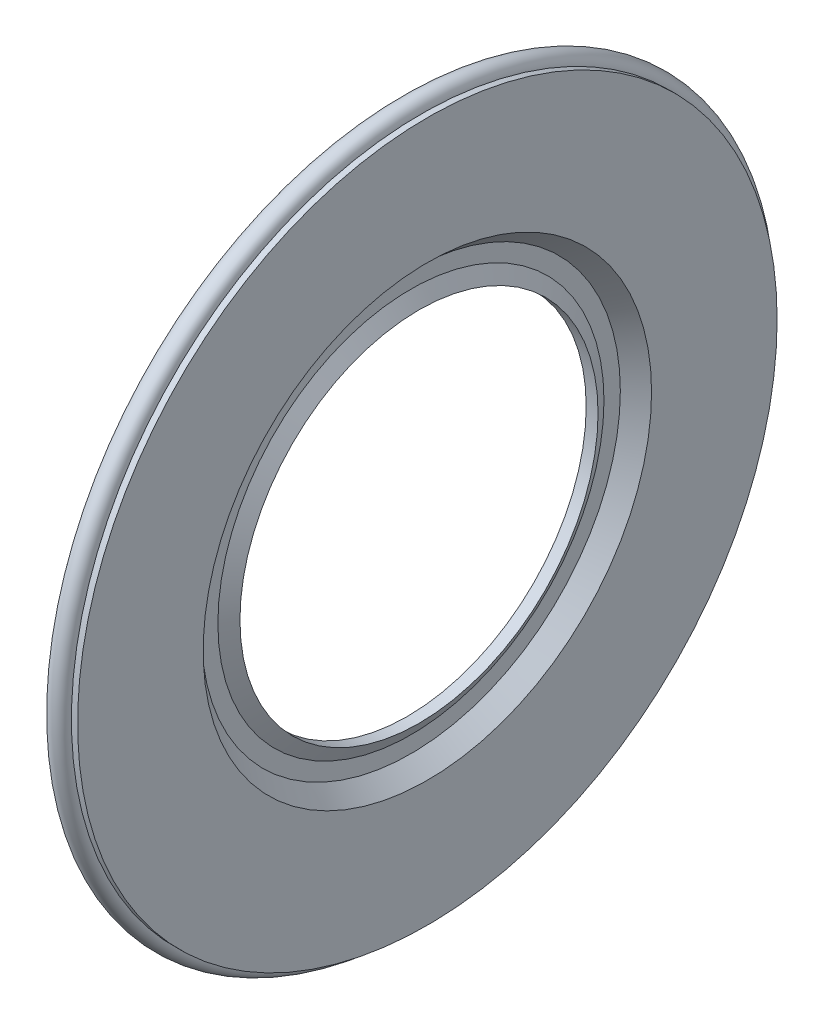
ISO-10303-21;
HEADER;
FILE_DESCRIPTION(('STEP AP214'),'2;1');
FILE_NAME('part.step','',(''),(''),'','','');
FILE_SCHEMA(('AUTOMOTIVE_DESIGN { 1 0 10303 214 1 1 1 1 }'));
ENDSEC;
DATA;
#1=APPLICATION_CONTEXT('core data for automotive mechanical design processes');
#2=APPLICATION_PROTOCOL_DEFINITION('international standard','automotive_design',2000,#1);
#3=PRODUCT_CONTEXT('',#1,'mechanical');
#4=PRODUCT('Part','Part','',(#3));
#5=PRODUCT_RELATED_PRODUCT_CATEGORY('part','',(#4));
#6=PRODUCT_DEFINITION_FORMATION('','',#4);
#7=PRODUCT_DEFINITION_CONTEXT('part definition',#1,'design');
#8=PRODUCT_DEFINITION('design','',#6,#7);
#9=PRODUCT_DEFINITION_SHAPE('','',#8);
#10=(LENGTH_UNIT() NAMED_UNIT(*) SI_UNIT(.MILLI.,.METRE.));
#11=(NAMED_UNIT(*) PLANE_ANGLE_UNIT() SI_UNIT($,.RADIAN.));
#12=(NAMED_UNIT(*) SI_UNIT($,.STERADIAN.) SOLID_ANGLE_UNIT());
#13=UNCERTAINTY_MEASURE_WITH_UNIT(LENGTH_MEASURE(1.E-05),#10,'distance_accuracy_value','');
#14=(GEOMETRIC_REPRESENTATION_CONTEXT(3) GLOBAL_UNCERTAINTY_ASSIGNED_CONTEXT((#13)) GLOBAL_UNIT_ASSIGNED_CONTEXT((#10,
#11,#12)) REPRESENTATION_CONTEXT('',''));
#15=CARTESIAN_POINT('',(0.,0.,0.));
#16=DIRECTION('',(0.,0.,1.));
#17=DIRECTION('',(1.,0.,0.));
#18=AXIS2_PLACEMENT_3D('',#15,#16,#17);
#19=CARTESIAN_POINT('',(4.58333333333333,0.,0.));
#20=DIRECTION('',(-1.,0.,0.));
#21=DIRECTION('',(0.,0.,1.));
#22=AXIS2_PLACEMENT_3D('',#19,#20,#21);
#23=CONICAL_SURFACE('',#22,3.08867513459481,1.0471975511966);
#24=CARTESIAN_POINT('',(4.68869975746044,0.,0.));
#25=DIRECTION('',(1.,0.,0.));
#26=DIRECTION('',(0.,0.,-1.));
#27=AXIS2_PLACEMENT_3D('',#24,#25,#26);
#28=CIRCLE('',#27,2.90617513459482);
#29=CARTESIAN_POINT('',(4.68869975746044,0.,-2.90617513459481));
#30=VERTEX_POINT('',#29);
#31=EDGE_CURVE('E76',#30,#30,#28,.T.);
#32=ORIENTED_EDGE('',*,*,#31,.T.);
#33=EDGE_LOOP('',(#32));
#34=FACE_BOUND('',#33,.T.);
#35=CARTESIAN_POINT('',(4.58333333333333,0.,0.));
#36=DIRECTION('',(1.,0.,0.));
#37=DIRECTION('',(0.,0.,-1.));
#38=AXIS2_PLACEMENT_3D('',#35,#36,#37);
#39=CIRCLE('',#38,3.08867513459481);
#40=CARTESIAN_POINT('',(4.58333333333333,0.,-3.08867513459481));
#41=VERTEX_POINT('',#40);
#42=EDGE_CURVE('E10',#41,#41,#39,.T.);
#43=ORIENTED_EDGE('',*,*,#42,.F.);
#44=EDGE_LOOP('',(#43));
#45=FACE_BOUND('',#44,.T.);
#46=ADVANCED_FACE('F15',(#34,#45),#23,.F.);
#47=CARTESIAN_POINT('',(4.58333333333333,3.62,0.));
#48=DIRECTION('',(-1.,0.,0.));
#49=DIRECTION('',(0.,0.,1.));
#50=AXIS2_PLACEMENT_3D('',#47,#48,#49);
#51=PLANE('',#50);
#52=ORIENTED_EDGE('',*,*,#42,.T.);
#53=EDGE_LOOP('',(#52));
#54=FACE_BOUND('',#53,.T.);
#55=CARTESIAN_POINT('',(4.58333333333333,0.,0.));
#56=DIRECTION('',(1.,0.,0.));
#57=DIRECTION('',(0.,0.,-1.));
#58=AXIS2_PLACEMENT_3D('',#55,#56,#57);
#59=CIRCLE('',#58,3.62);
#60=CARTESIAN_POINT('',(4.58333333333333,0.,-3.62));
#61=VERTEX_POINT('',#60);
#62=EDGE_CURVE('E22',#61,#61,#59,.T.);
#63=ORIENTED_EDGE('',*,*,#62,.F.);
#64=EDGE_LOOP('',(#63));
#65=FACE_BOUND('',#64,.T.);
#66=ADVANCED_FACE('F97',(#54,#65),#51,.T.);
#67=CARTESIAN_POINT('',(4.58333333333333,0.,0.));
#68=DIRECTION('',(1.,0.,0.));
#69=DIRECTION('',(0.,0.,-1.));
#70=AXIS2_PLACEMENT_3D('',#67,#68,#69);
#71=CONICAL_SURFACE('',#70,3.62,0.732815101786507);
#72=CARTESIAN_POINT('',(4.68333333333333,0.,0.));
#73=DIRECTION('',(1.,0.,0.));
#74=DIRECTION('',(0.,0.,-1.));
#75=AXIS2_PLACEMENT_3D('',#72,#73,#74);
#76=CIRCLE('',#75,3.71);
#77=CARTESIAN_POINT('',(4.68333333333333,0.,-3.71));
#78=VERTEX_POINT('',#77);
#79=EDGE_CURVE('E31',#78,#78,#76,.T.);
#80=ORIENTED_EDGE('',*,*,#79,.F.);
#81=EDGE_LOOP('',(#80));
#82=FACE_BOUND('',#81,.T.);
#83=ORIENTED_EDGE('',*,*,#62,.T.);
#84=EDGE_LOOP('',(#83));
#85=FACE_BOUND('',#84,.T.);
#86=ADVANCED_FACE('F101',(#82,#85),#71,.T.);
#87=CARTESIAN_POINT('',(4.68333333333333,3.71,0.));
#88=DIRECTION('',(1.,0.,0.));
#89=DIRECTION('',(0.,0.,-1.));
#90=AXIS2_PLACEMENT_3D('',#87,#88,#89);
#91=PLANE('',#90);
#92=CARTESIAN_POINT('',(4.68333333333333,0.,0.));
#93=DIRECTION('',(1.,0.,0.));
#94=DIRECTION('',(0.,0.,-1.));
#95=AXIS2_PLACEMENT_3D('',#92,#93,#94);
#96=CIRCLE('',#95,4.79);
#97=CARTESIAN_POINT('',(4.68333333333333,0.,-4.79));
#98=VERTEX_POINT('',#97);
#99=EDGE_CURVE('E38',#98,#98,#96,.T.);
#100=ORIENTED_EDGE('',*,*,#99,.F.);
#101=EDGE_LOOP('',(#100));
#102=FACE_BOUND('',#101,.T.);
#103=ORIENTED_EDGE('',*,*,#79,.T.);
#104=EDGE_LOOP('',(#103));
#105=FACE_BOUND('',#104,.T.);
#106=ADVANCED_FACE('F105',(#102,#105),#91,.F.);
#107=CARTESIAN_POINT('',(4.68333333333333,0.,0.));
#108=DIRECTION('',(-1.,0.,0.));
#109=DIRECTION('',(0.,0.,1.));
#110=AXIS2_PLACEMENT_3D('',#107,#108,#109);
#111=CONICAL_SURFACE('',#110,4.79,0.732815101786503);
#112=CARTESIAN_POINT('',(4.58333333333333,0.,0.));
#113=DIRECTION('',(1.,0.,0.));
#114=DIRECTION('',(0.,0.,-1.));
#115=AXIS2_PLACEMENT_3D('',#112,#113,#114);
#116=CIRCLE('',#115,4.88);
#117=CARTESIAN_POINT('',(4.58333333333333,0.,-4.88));
#118=VERTEX_POINT('',#117);
#119=EDGE_CURVE('E44',#118,#118,#116,.T.);
#120=ORIENTED_EDGE('',*,*,#119,.F.);
#121=EDGE_LOOP('',(#120));
#122=FACE_BOUND('',#121,.T.);
#123=ORIENTED_EDGE('',*,*,#99,.T.);
#124=EDGE_LOOP('',(#123));
#125=FACE_BOUND('',#124,.T.);
#126=ADVANCED_FACE('F112',(#122,#125),#111,.F.);
#127=CARTESIAN_POINT('',(4.58333333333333,5.67688747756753,0.));
#128=DIRECTION('',(-1.,0.,0.));
#129=DIRECTION('',(0.,0.,1.));
#130=AXIS2_PLACEMENT_3D('',#127,#128,#129);
#131=PLANE('',#130);
#132=ORIENTED_EDGE('',*,*,#119,.T.);
#133=EDGE_LOOP('',(#132));
#134=FACE_BOUND('',#133,.T.);
#135=CARTESIAN_POINT('',(4.58333333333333,0.,0.));
#136=DIRECTION('',(1.,0.,0.));
#137=DIRECTION('',(0.,0.,-1.));
#138=AXIS2_PLACEMENT_3D('',#135,#136,#137);
#139=CIRCLE('',#138,5.67688747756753);
#140=CARTESIAN_POINT('',(4.58333333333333,0.,-5.67688747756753));
#141=VERTEX_POINT('',#140);
#142=EDGE_CURVE('E48',#141,#141,#139,.T.);
#143=ORIENTED_EDGE('',*,*,#142,.F.);
#144=EDGE_LOOP('',(#143));
#145=FACE_BOUND('',#144,.T.);
#146=ADVANCED_FACE('F116',(#134,#145),#131,.T.);
#147=CARTESIAN_POINT('',(4.75,0.,0.));
#148=DIRECTION('',(1.,0.,0.));
#149=DIRECTION('',(0.,0.,-1.));
#150=AXIS2_PLACEMENT_3D('',#147,#148,#149);
#151=TOROIDAL_SURFACE('',#150,5.67688747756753,0.166666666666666);
#152=CARTESIAN_POINT('',(4.91666666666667,0.,0.));
#153=DIRECTION('',(1.,0.,0.));
#154=DIRECTION('',(0.,0.,-1.));
#155=AXIS2_PLACEMENT_3D('',#152,#153,#154);
#156=CIRCLE('',#155,5.67688747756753);
#157=CARTESIAN_POINT('',(4.91666666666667,0.,-5.67688747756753));
#158=VERTEX_POINT('',#157);
#159=EDGE_CURVE('E52',#158,#158,#156,.T.);
#160=ORIENTED_EDGE('',*,*,#159,.F.);
#161=EDGE_LOOP('',(#160));
#162=FACE_BOUND('',#161,.T.);
#163=ORIENTED_EDGE('',*,*,#142,.T.);
#164=EDGE_LOOP('',(#163));
#165=FACE_BOUND('',#164,.T.);
#166=ADVANCED_FACE('F120',(#162,#165),#151,.T.);
#167=CARTESIAN_POINT('',(5.,0.,0.));
#168=DIRECTION('',(1.,0.,0.));
#169=DIRECTION('',(0.,0.,-1.));
#170=AXIS2_PLACEMENT_3D('',#167,#168,#169);
#171=CYLINDRICAL_SURFACE('',#170,5.67688747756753);
#172=CARTESIAN_POINT('',(5.01666666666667,0.,0.));
#173=DIRECTION('',(1.,0.,0.));
#174=DIRECTION('',(0.,0.,-1.));
#175=AXIS2_PLACEMENT_3D('',#172,#173,#174);
#176=CIRCLE('',#175,5.67688747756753);
#177=CARTESIAN_POINT('',(5.01666666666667,0.,-5.67688747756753));
#178=VERTEX_POINT('',#177);
#179=EDGE_CURVE('E56',#178,#178,#176,.T.);
#180=ORIENTED_EDGE('',*,*,#179,.F.);
#181=EDGE_LOOP('',(#180));
#182=FACE_BOUND('',#181,.T.);
#183=ORIENTED_EDGE('',*,*,#159,.T.);
#184=EDGE_LOOP('',(#183));
#185=FACE_BOUND('',#184,.T.);
#186=ADVANCED_FACE('F124',(#182,#185),#171,.T.);
#187=CARTESIAN_POINT('',(5.01666666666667,5.67688747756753,0.));
#188=DIRECTION('',(-1.,0.,0.));
#189=DIRECTION('',(0.,0.,1.));
#190=AXIS2_PLACEMENT_3D('',#187,#188,#189);
#191=PLANE('',#190);
#192=CARTESIAN_POINT('',(5.01666666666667,0.,0.));
#193=DIRECTION('',(1.,0.,0.));
#194=DIRECTION('',(0.,0.,-1.));
#195=AXIS2_PLACEMENT_3D('',#192,#193,#194);
#196=CIRCLE('',#195,3.63899576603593);
#197=CARTESIAN_POINT('',(5.01666666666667,0.,-3.63899576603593));
#198=VERTEX_POINT('',#197);
#199=EDGE_CURVE('E60',#198,#198,#196,.T.);
#200=ORIENTED_EDGE('',*,*,#199,.F.);
#201=EDGE_LOOP('',(#200));
#202=FACE_BOUND('',#201,.T.);
#203=ORIENTED_EDGE('',*,*,#179,.T.);
#204=EDGE_LOOP('',(#203));
#205=FACE_BOUND('',#204,.T.);
#206=ADVANCED_FACE('F128',(#202,#205),#191,.F.);
#207=CARTESIAN_POINT('',(5.01666666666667,0.,0.));
#208=DIRECTION('',(1.,0.,0.));
#209=DIRECTION('',(0.,0.,-1.));
#210=AXIS2_PLACEMENT_3D('',#207,#208,#209);
#211=CONICAL_SURFACE('',#210,3.63899576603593,0.732815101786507);
#212=CARTESIAN_POINT('',(4.75,0.,0.));
#213=DIRECTION('',(1.,0.,0.));
#214=DIRECTION('',(0.,0.,-1.));
#215=AXIS2_PLACEMENT_3D('',#212,#213,#214);
#216=CIRCLE('',#215,3.39899576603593);
#217=CARTESIAN_POINT('',(4.75,0.,-3.39899576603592));
#218=VERTEX_POINT('',#217);
#219=EDGE_CURVE('E64',#218,#218,#216,.T.);
#220=ORIENTED_EDGE('',*,*,#219,.F.);
#221=EDGE_LOOP('',(#220));
#222=FACE_BOUND('',#221,.T.);
#223=ORIENTED_EDGE('',*,*,#199,.T.);
#224=EDGE_LOOP('',(#223));
#225=FACE_BOUND('',#224,.T.);
#226=ADVANCED_FACE('F132',(#222,#225),#211,.F.);
#227=CARTESIAN_POINT('',(4.75,3.13333333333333,0.));
#228=DIRECTION('',(1.,0.,0.));
#229=DIRECTION('',(0.,0.,-1.));
#230=AXIS2_PLACEMENT_3D('',#227,#228,#229);
#231=PLANE('',#230);
#232=ORIENTED_EDGE('',*,*,#219,.T.);
#233=EDGE_LOOP('',(#232));
#234=FACE_BOUND('',#233,.T.);
#235=CARTESIAN_POINT('',(4.75,0.,0.));
#236=DIRECTION('',(1.,0.,0.));
#237=DIRECTION('',(0.,0.,-1.));
#238=AXIS2_PLACEMENT_3D('',#235,#236,#237);
#239=CIRCLE('',#238,3.13333333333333);
#240=CARTESIAN_POINT('',(4.75,0.,-3.13333333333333));
#241=VERTEX_POINT('',#240);
#242=EDGE_CURVE('E68',#241,#241,#239,.T.);
#243=ORIENTED_EDGE('',*,*,#242,.F.);
#244=EDGE_LOOP('',(#243));
#245=FACE_BOUND('',#244,.T.);
#246=ADVANCED_FACE('F93',(#234,#245),#231,.T.);
#247=CARTESIAN_POINT('',(4.88114984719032,0.,0.));
#248=DIRECTION('',(-1.,0.,0.));
#249=DIRECTION('',(0.,0.,1.));
#250=AXIS2_PLACEMENT_3D('',#247,#248,#249);
#251=CONICAL_SURFACE('',#250,2.90617513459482,1.0471975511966);
#252=ORIENTED_EDGE('',*,*,#242,.T.);
#253=EDGE_LOOP('',(#252));
#254=FACE_BOUND('',#253,.T.);
#255=CARTESIAN_POINT('',(4.88114984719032,0.,0.));
#256=DIRECTION('',(1.,0.,0.));
#257=DIRECTION('',(0.,0.,-1.));
#258=AXIS2_PLACEMENT_3D('',#255,#256,#257);
#259=CIRCLE('',#258,2.90617513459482);
#260=CARTESIAN_POINT('',(4.88114984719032,0.,-2.90617513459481));
#261=VERTEX_POINT('',#260);
#262=EDGE_CURVE('E72',#261,#261,#259,.T.);
#263=ORIENTED_EDGE('',*,*,#262,.F.);
#264=EDGE_LOOP('',(#263));
#265=FACE_BOUND('',#264,.T.);
#266=ADVANCED_FACE('F86',(#254,#265),#251,.T.);
#267=CARTESIAN_POINT('',(5.,0.,0.));
#268=DIRECTION('',(1.,0.,0.));
#269=DIRECTION('',(0.,0.,-1.));
#270=AXIS2_PLACEMENT_3D('',#267,#268,#269);
#271=CYLINDRICAL_SURFACE('',#270,2.90617513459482);
#272=ORIENTED_EDGE('',*,*,#262,.T.);
#273=EDGE_LOOP('',(#272));
#274=FACE_BOUND('',#273,.T.);
#275=ORIENTED_EDGE('',*,*,#31,.F.);
#276=EDGE_LOOP('',(#275));
#277=FACE_BOUND('',#276,.T.);
#278=ADVANCED_FACE('F84',(#274,#277),#271,.F.);
#279=CLOSED_SHELL('',(#46,#66,#86,#106,#126,#146,#166,#186,#206,#226,#246,#266,#278));
#280=MANIFOLD_SOLID_BREP('B1',#279);
#281=ADVANCED_BREP_SHAPE_REPRESENTATION('',(#18,#280),#14);
#282=SHAPE_DEFINITION_REPRESENTATION(#9,#281);
ENDSEC;
END-ISO-10303-21;
